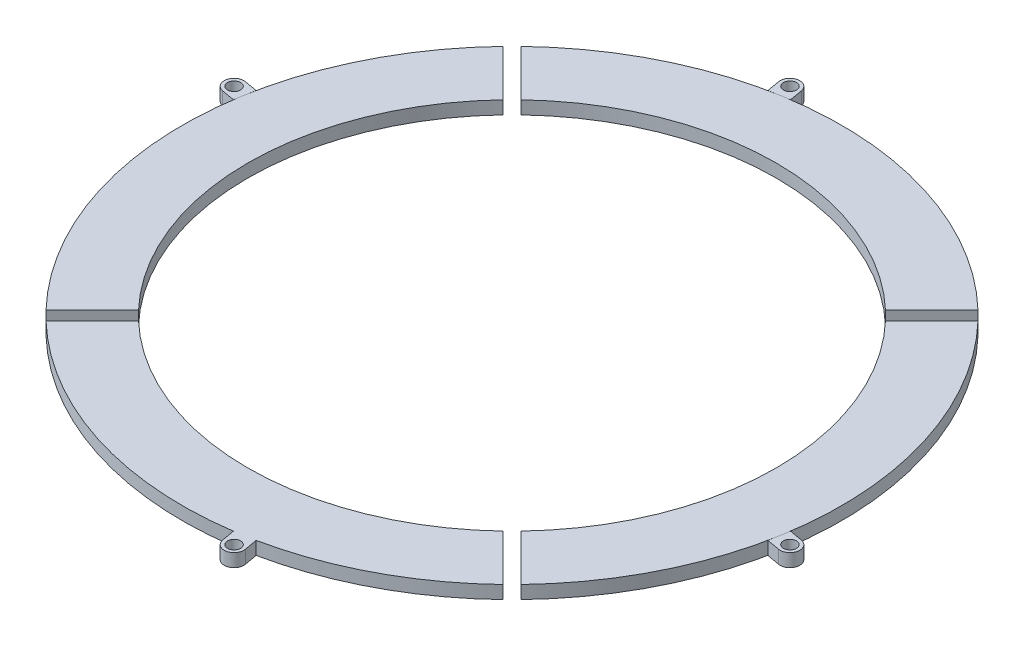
from build123d import *

# Parameters (mm, degrees)
EXTRUDE_1_DEPTH   = 2
EXTRUDE_1_2_DEPTH = 2
EXTRUDE_1_3_DEPTH = 2
EXTRUDE_1_4_DEPTH = 2
SKETCH_2_R        = 1
EXTRUDE_2_DEPTH   = 2


with BuildPart() as part:
    # Sketch 1 → Extrude 1 (new body)
    with BuildSketch(Plane(origin=(0, 0, 0), x_dir=(1, 0, 0), z_dir=(0, 1, 0))):
        with BuildLine():
            Line((-36.338272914, -34.924059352), (-29.265468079, -27.851254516))
            ThreePointArc((-29.265468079, -27.851254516), (-40.4, 0), (-29.265468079, 27.851254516))
            Line((-29.265468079, 27.851254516), (-36.338272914, 34.924059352))
            ThreePointArc((-36.338272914, 34.924059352), (-50.4, 0), (-36.338272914, -34.924059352))
        make_face()
    extrude(amount=EXTRUDE_1_DEPTH)


with BuildPart() as body_2:
    # Sketch 1 → Extrude 1 2 (new body)
    with BuildSketch(Plane(origin=(0, 0, 0), x_dir=(1, 0, 0), z_dir=(0, 1, 0))):
        with BuildLine():
            ThreePointArc((-27.851254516, 29.265468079), (0, 40.4), (27.851254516, 29.265468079))
            Line((27.851254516, 29.265468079), (34.924059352, 36.338272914))
            ThreePointArc((34.924059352, 36.338272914), (0, 50.4), (-34.924059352, 36.338272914))
            Line((-34.924059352, 36.338272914), (-27.851254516, 29.265468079))
        make_face()
    extrude(amount=EXTRUDE_1_2_DEPTH)


with BuildPart() as body_3:
    # Sketch 1 → Extrude 1 3 (new body)
    with BuildSketch(Plane(origin=(0, 0, 0), x_dir=(1, 0, 0), z_dir=(0, 1, 0))):
        with BuildLine():
            Line((36.338272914, 34.924059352), (29.265468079, 27.851254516))
            ThreePointArc((29.265468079, 27.851254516), (37.513230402, 14.997251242), (40.4, 0))
            ThreePointArc((40.4, 0), (37.513230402, -14.997251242), (29.265468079, -27.851254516))
            Line((29.265468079, -27.851254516), (36.338272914, -34.924059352))
            ThreePointArc((36.338272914, -34.924059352), (46.752587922, -18.824333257), (50.4, 0))
            ThreePointArc((50.4, 0), (46.752587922, 18.824333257), (36.338272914, 34.924059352))
        make_face()
    extrude(amount=EXTRUDE_1_3_DEPTH)


with BuildPart() as body_4:
    # Sketch 1 → Extrude 1 4 (new body)
    with BuildSketch(Plane(origin=(0, 0, 0), x_dir=(1, 0, 0), z_dir=(0, 1, 0))):
        with BuildLine():
            Line((34.924059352, -36.338272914), (27.851254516, -29.265468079))
            ThreePointArc((27.851254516, -29.265468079), (0, -40.4), (-27.851254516, -29.265468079))
            Line((-27.851254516, -29.265468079), (-34.924059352, -36.338272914))
            ThreePointArc((-34.924059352, -36.338272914), (0, -50.4), (34.924059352, -36.338272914))
        make_face()
    extrude(amount=EXTRUDE_1_4_DEPTH)

    # Sketch 2 → Extrude 2 (add)
    # profile 1 of 4: a face of its own
    with BuildSketch(Plane.XZ):
        with BuildLine():
            Line((10.22520285, 49.351851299), (7.270779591, 49.872795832))
            Line((7.270779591, 49.872795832), (7.62195288, 51.864398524))
            ThreePointArc((7.62195288, 51.864398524), (9.359636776, 53.081137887), (10.576376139, 51.343453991))
            Line((10.576376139, 51.343453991), (10.22520285, 49.351851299))
        make_face()
        with Locations(Location((9.09916451, 51.603926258, 0), (0, 0, 270))):
            Circle(SKETCH_2_R, mode=Mode.SUBTRACT)
    # profile 2 of 4: a face of its own
    with BuildSketch(Plane.XZ):
        with BuildLine():
            Line((49.351851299, 10.22520285), (51.343453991, 10.576376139))
            ThreePointArc((51.343453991, 10.576376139), (53.081137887, 9.359636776), (51.864398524, 7.62195288))
            Line((51.864398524, 7.62195288), (49.872795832, 7.270779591))
            Line((49.872795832, 7.270779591), (49.351851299, 10.22520285))
        make_face()
        with Locations(Location((51.603926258, 9.09916451, 0), (0, 0, 90))):
            Circle(SKETCH_2_R, mode=Mode.SUBTRACT)
    # profile 3 of 4: a face of its own
    with BuildSketch(Plane.XZ):
        with BuildLine():
            Line((-49.351851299, -10.22520285), (-51.343453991, -10.576376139))
            ThreePointArc((-51.343453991, -10.576376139), (-53.081137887, -9.359636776), (-51.864398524, -7.62195288))
            Line((-51.864398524, -7.62195288), (-49.872795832, -7.270779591))
            Line((-49.872795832, -7.270779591), (-49.351851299, -10.22520285))
        make_face()
        with Locations(Location((-51.603926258, -9.09916451, 0), (0, 0, 90))):
            Circle(SKETCH_2_R, mode=Mode.SUBTRACT)
    # profile 4 of 4: a face of its own
    with BuildSketch(Plane.XZ):
        with BuildLine():
            Line((-10.22520285, -49.351851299), (-7.270779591, -49.872795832))
            Line((-7.270779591, -49.872795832), (-7.62195288, -51.864398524))
            ThreePointArc((-7.62195288, -51.864398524), (-9.359636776, -53.081137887), (-10.576376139, -51.343453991))
            Line((-10.576376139, -51.343453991), (-10.22520285, -49.351851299))
        make_face()
        with Locations(Location((-9.09916451, -51.603926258, 0), (0, 0, 270))):
            Circle(SKETCH_2_R, mode=Mode.SUBTRACT)
    extrude(amount=-EXTRUDE_2_DEPTH)


with BuildPart() as extrude_2_piece_1:
    # of the separate pieces the step leaves, piece 1, a body of its own (extrude_2_pieces)
    add(body_4.part.solids().sort_by_distance((34.924059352, 0, 36.338272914))[0])


with BuildPart() as extrude_2_piece_2:
    # of the separate pieces the step leaves, piece 2, a body of its own (extrude_2_pieces)
    add(body_4.part.solids().sort_by_distance((-10.576376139, 0, -51.343453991))[0])


with BuildPart() as extrude_2_piece_3:
    # of the separate pieces the step leaves, piece 3, a body of its own (extrude_2_pieces)
    add(body_4.part.solids().sort_by_distance((49.351851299, 0, 10.22520285))[0])


with BuildPart() as extrude_2_piece_4:
    # of the separate pieces the step leaves, piece 4, a body of its own (extrude_2_pieces)
    add(body_4.part.solids().sort_by_distance((-51.864398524, 0, -7.62195288))[0])


solid = Compound([part.part, body_2.part, body_3.part, extrude_2_piece_1.part, extrude_2_piece_2.part, extrude_2_piece_3.part, extrude_2_piece_4.part])
